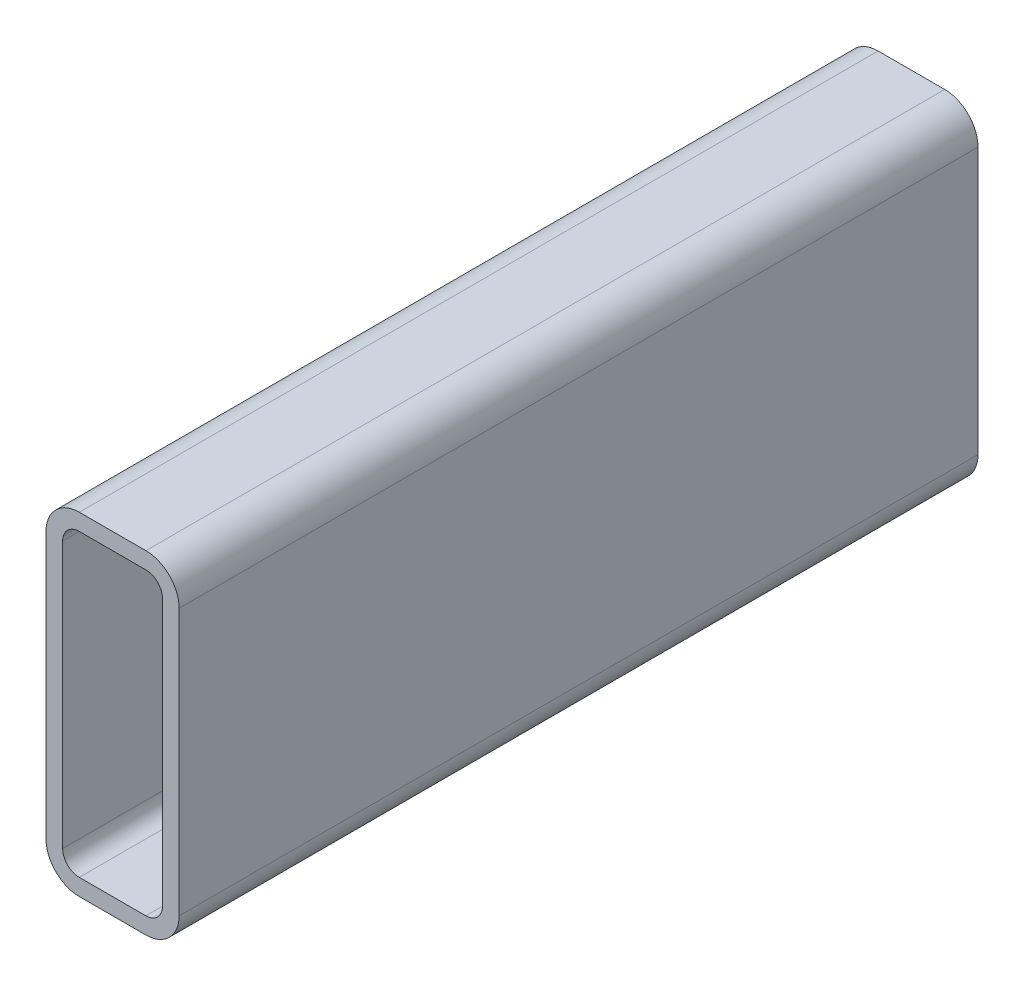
from build123d import *

# Parameters (mm, degrees)
BOSS_EXTRUDE1_DEPTH = 304.8


with BuildPart() as part:
    # Sketch1 → Boss-Extrude1 (new body)
    with BuildSketch(Plane.XY):
        with BuildLine():
            Line((12.7, 127), (38.1, 127))
            ThreePointArc((38.1, 127), (47.080256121, 123.280256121), (50.8, 114.3))
            Line((50.8, 114.3), (50.8, 12.7))
            ThreePointArc((50.8, 12.7), (47.080256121, 3.719743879), (38.1, 0))
            Line((38.1, 0), (12.7, 0))
            ThreePointArc((12.7, 0), (3.719743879, 3.719743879), (0, 12.7))
            Line((0, 12.7), (0, 114.3))
            ThreePointArc((0, 114.3), (3.719743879, 123.280256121), (12.7, 127))
        make_face()
        with BuildLine():
            Line((12.7, 120.65), (38.1, 120.65))
            ThreePointArc((38.1, 120.65), (42.590128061, 118.790128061), (44.45, 114.3))
            Line((44.45, 114.3), (44.45, 12.7))
            ThreePointArc((44.45, 12.7), (42.590128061, 8.209871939), (38.1, 6.35))
            Line((38.1, 6.35), (12.7, 6.35))
            ThreePointArc((12.7, 6.35), (8.209871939, 8.209871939), (6.35, 12.7))
            Line((6.35, 12.7), (6.35, 114.3))
            ThreePointArc((6.35, 114.3), (8.209871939, 118.790128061), (12.7, 120.65))
        make_face(mode=Mode.SUBTRACT)
    extrude(amount=BOSS_EXTRUDE1_DEPTH)


solid = part.part
